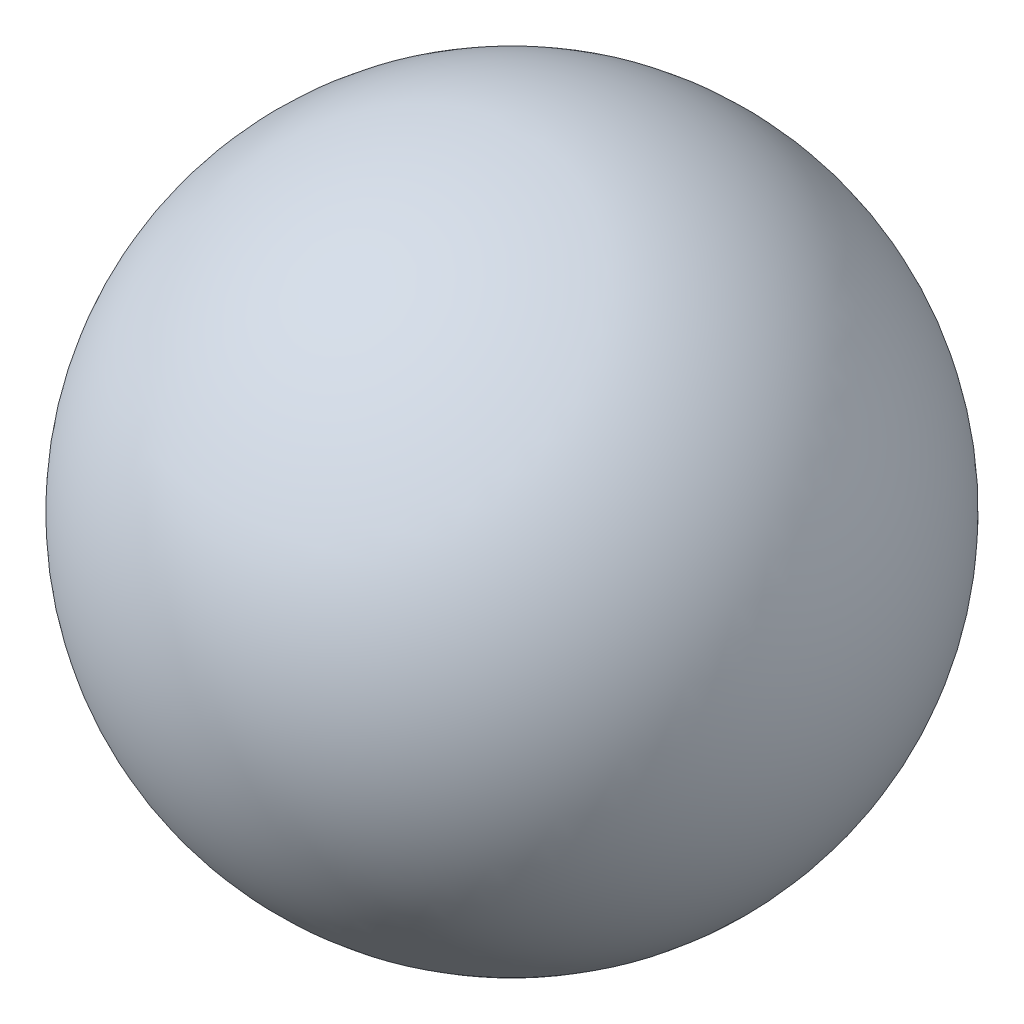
from build123d import *

# Parameters (mm, degrees)
SKETCH2_R          = 6
CUT_EXTRUDE1_DEPTH = 12


with BuildPart() as part:
    # Sketch1 → Revolve1 (revolve)
    with BuildSketch(Plane.XY):
        with BuildLine():
            Line((0, -26), (0, 30))
            ThreePointArc((0, 30), (28.982753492, 7.745966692), (14.966629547, -26))
            Line((14.966629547, -26), (0, -26))
        make_face()
    revolve(axis=Axis((0, -26, 0), (0, 1, 0)))

    # Sketch2 → Cut-Extrude1 (cut)
    with BuildSketch(Plane.XZ.offset(26)):
        with Locations(Location((0, 0, 0), (0, 0, 270))):
            Circle(SKETCH2_R)
    extrude(amount=-CUT_EXTRUDE1_DEPTH, mode=Mode.SUBTRACT)


solid = part.part
